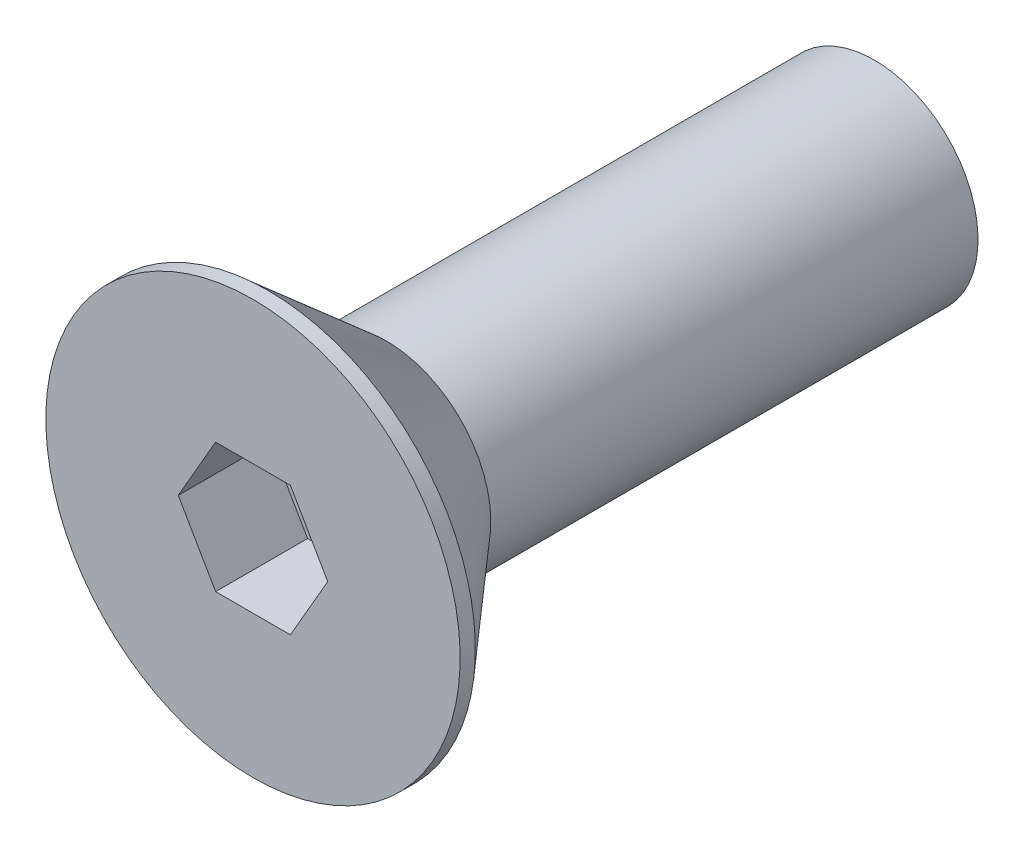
from build123d import *

# Parameters (mm, degrees)
CUT_EXTRUDE1_DEPTH = 2.8194


with BuildPart() as part:
    # Sketch1 → Revolve1 (revolve)
    with BuildSketch(Plane(origin=(0, 0, 0), x_dir=(0, 0, -1), z_dir=(1, 0, 0)), mode=Mode.PRIVATE) as revolve1_sk:
        Polygon((-4.0894, 0), (-4.0894, 6.35), (-3.623200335, 6.35), (0, 3.2004), (0, 3.175), (14.9606, 3.175), (14.9606, 0), align=None)
    revolve(revolve1_sk.sketch.rotate(Axis((0, 0, 5.584882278), (0, 0, -1)), 180), axis=Axis((0, 0, 5.584882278), (0, 0, -1)))

    # Sketch2 → Cut-Extrude1 (cut)
    with BuildSketch(Plane.XY.offset(4.0894)):
        Polygon((1.14567944, -1.984375), (2.291358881, 0), (1.14567944, 1.984375), (-1.14567944, 1.984375), (-2.291358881, 0), (-1.14567944, -1.984375), align=None)
    extrude(amount=-CUT_EXTRUDE1_DEPTH, mode=Mode.SUBTRACT)


solid = part.part
